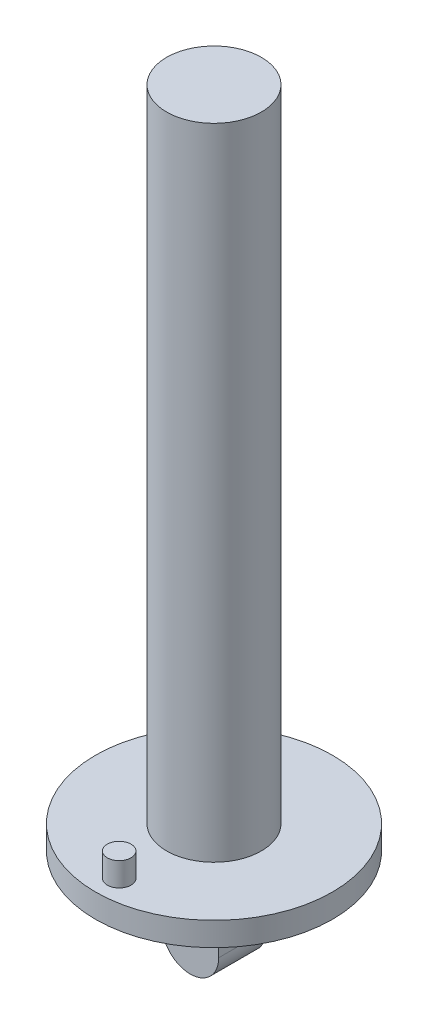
ISO-10303-21;
HEADER;
FILE_DESCRIPTION(('STEP AP214'),'2;1');
FILE_NAME('part.step','',(''),(''),'','','');
FILE_SCHEMA(('AUTOMOTIVE_DESIGN { 1 0 10303 214 1 1 1 1 }'));
ENDSEC;
DATA;
#1=APPLICATION_CONTEXT('core data for automotive mechanical design processes');
#2=APPLICATION_PROTOCOL_DEFINITION('international standard','automotive_design',2000,#1);
#3=PRODUCT_CONTEXT('',#1,'mechanical');
#4=PRODUCT('Part','Part','',(#3));
#5=PRODUCT_RELATED_PRODUCT_CATEGORY('part','',(#4));
#6=PRODUCT_DEFINITION_FORMATION('','',#4);
#7=PRODUCT_DEFINITION_CONTEXT('part definition',#1,'design');
#8=PRODUCT_DEFINITION('design','',#6,#7);
#9=PRODUCT_DEFINITION_SHAPE('','',#8);
#10=(LENGTH_UNIT() NAMED_UNIT(*) SI_UNIT(.MILLI.,.METRE.));
#11=(NAMED_UNIT(*) PLANE_ANGLE_UNIT() SI_UNIT($,.RADIAN.));
#12=(NAMED_UNIT(*) SI_UNIT($,.STERADIAN.) SOLID_ANGLE_UNIT());
#13=UNCERTAINTY_MEASURE_WITH_UNIT(LENGTH_MEASURE(1.E-05),#10,'distance_accuracy_value','');
#14=(GEOMETRIC_REPRESENTATION_CONTEXT(3) GLOBAL_UNCERTAINTY_ASSIGNED_CONTEXT((#13)) GLOBAL_UNIT_ASSIGNED_CONTEXT((#10,
#11,#12)) REPRESENTATION_CONTEXT('',''));
#15=CARTESIAN_POINT('',(0.,0.,0.));
#16=DIRECTION('',(0.,0.,1.));
#17=DIRECTION('',(1.,0.,0.));
#18=AXIS2_PLACEMENT_3D('',#15,#16,#17);
#19=CARTESIAN_POINT('',(0.,0.,0.));
#20=DIRECTION('',(0.,1.,0.));
#21=DIRECTION('',(-1.,0.,0.));
#22=AXIS2_PLACEMENT_3D('',#19,#20,#21);
#23=PLANE('',#22);
#24=CARTESIAN_POINT('',(0.,0.,0.));
#25=DIRECTION('',(0.,1.,0.));
#26=DIRECTION('',(-1.,0.,0.));
#27=AXIS2_PLACEMENT_3D('',#24,#25,#26);
#28=CIRCLE('',#27,25.);
#29=CARTESIAN_POINT('',(-25.,0.,0.));
#30=VERTEX_POINT('',#29);
#31=EDGE_CURVE('E121',#30,#30,#28,.T.);
#32=ORIENTED_EDGE('',*,*,#31,.F.);
#33=EDGE_LOOP('',(#32));
#34=FACE_BOUND('',#33,.T.);
#35=DIRECTION('',(-1.,0.,0.));
#36=VECTOR('',#35,1.);
#37=CARTESIAN_POINT('',(-6.,0.,-5.));
#38=LINE('',#37,#36);
#39=CARTESIAN_POINT('',(6.,0.,-5.));
#40=VERTEX_POINT('',#39);
#41=CARTESIAN_POINT('',(-6.,0.,-5.));
#42=VERTEX_POINT('',#41);
#43=EDGE_CURVE('E105',#40,#42,#38,.T.);
#44=ORIENTED_EDGE('',*,*,#43,.T.);
#45=DIRECTION('',(0.,0.,1.));
#46=VECTOR('',#45,1.);
#47=CARTESIAN_POINT('',(-6.,0.,-5.));
#48=LINE('',#47,#46);
#49=CARTESIAN_POINT('',(-6.,0.,5.));
#50=VERTEX_POINT('',#49);
#51=EDGE_CURVE('E97',#42,#50,#48,.T.);
#52=ORIENTED_EDGE('',*,*,#51,.T.);
#53=DIRECTION('',(-1.,0.,0.));
#54=VECTOR('',#53,1.);
#55=CARTESIAN_POINT('',(-6.,0.,5.));
#56=LINE('',#55,#54);
#57=CARTESIAN_POINT('',(6.,0.,5.));
#58=VERTEX_POINT('',#57);
#59=EDGE_CURVE('E82',#58,#50,#56,.T.);
#60=ORIENTED_EDGE('',*,*,#59,.F.);
#61=DIRECTION('',(0.,0.,1.));
#62=VECTOR('',#61,1.);
#63=CARTESIAN_POINT('',(6.,0.,-5.));
#64=LINE('',#63,#62);
#65=EDGE_CURVE('E107',#40,#58,#64,.T.);
#66=ORIENTED_EDGE('',*,*,#65,.F.);
#67=EDGE_LOOP('',(#44,#52,#60,#66));
#68=FACE_BOUND('',#67,.T.);
#69=ADVANCED_FACE('F35',(#34,#68),#23,.F.);
#70=CARTESIAN_POINT('',(0.,140.,0.));
#71=DIRECTION('',(0.,1.,0.));
#72=DIRECTION('',(-1.,0.,0.));
#73=AXIS2_PLACEMENT_3D('',#70,#71,#72);
#74=CYLINDRICAL_SURFACE('',#73,25.);
#75=CARTESIAN_POINT('',(0.,5.,0.));
#76=DIRECTION('',(0.,1.,0.));
#77=DIRECTION('',(-1.,0.,0.));
#78=AXIS2_PLACEMENT_3D('',#75,#76,#77);
#79=CIRCLE('',#78,25.);
#80=CARTESIAN_POINT('',(-25.,5.00000000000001,0.));
#81=VERTEX_POINT('',#80);
#82=EDGE_CURVE('E118',#81,#81,#79,.T.);
#83=ORIENTED_EDGE('',*,*,#82,.F.);
#84=EDGE_LOOP('',(#83));
#85=FACE_BOUND('',#84,.T.);
#86=ORIENTED_EDGE('',*,*,#31,.T.);
#87=EDGE_LOOP('',(#86));
#88=FACE_BOUND('',#87,.T.);
#89=ADVANCED_FACE('F156',(#85,#88),#74,.T.);
#90=CARTESIAN_POINT('',(25.,5.,0.));
#91=DIRECTION('',(0.,-1.,0.));
#92=DIRECTION('',(1.,0.,0.));
#93=AXIS2_PLACEMENT_3D('',#90,#91,#92);
#94=PLANE('',#93);
#95=CARTESIAN_POINT('',(0.,5.,20.));
#96=DIRECTION('',(0.,-1.,0.));
#97=DIRECTION('',(1.,0.,0.));
#98=AXIS2_PLACEMENT_3D('',#95,#96,#97);
#99=CIRCLE('',#98,2.5);
#100=CARTESIAN_POINT('',(2.5,5.,20.));
#101=VERTEX_POINT('',#100);
#102=EDGE_CURVE('E11',#101,#101,#99,.F.);
#103=ORIENTED_EDGE('',*,*,#102,.F.);
#104=EDGE_LOOP('',(#103));
#105=FACE_BOUND('',#104,.T.);
#106=CARTESIAN_POINT('',(0.,5.,0.));
#107=DIRECTION('',(0.,1.,0.));
#108=DIRECTION('',(-1.,0.,0.));
#109=AXIS2_PLACEMENT_3D('',#106,#107,#108);
#110=CIRCLE('',#109,10.);
#111=CARTESIAN_POINT('',(-10.,5.,0.));
#112=VERTEX_POINT('',#111);
#113=EDGE_CURVE('E110',#112,#112,#110,.T.);
#114=ORIENTED_EDGE('',*,*,#113,.F.);
#115=EDGE_LOOP('',(#114));
#116=FACE_BOUND('',#115,.T.);
#117=ORIENTED_EDGE('',*,*,#82,.T.);
#118=EDGE_LOOP('',(#117));
#119=FACE_BOUND('',#118,.T.);
#120=ADVANCED_FACE('F162',(#105,#116,#119),#94,.F.);
#121=CARTESIAN_POINT('',(0.,140.,0.));
#122=DIRECTION('',(0.,1.,0.));
#123=DIRECTION('',(-1.,0.,0.));
#124=AXIS2_PLACEMENT_3D('',#121,#122,#123);
#125=CYLINDRICAL_SURFACE('',#124,10.);
#126=CARTESIAN_POINT('',(0.,140.,0.));
#127=DIRECTION('',(0.,1.,0.));
#128=DIRECTION('',(-1.,0.,0.));
#129=AXIS2_PLACEMENT_3D('',#126,#127,#128);
#130=CIRCLE('',#129,10.);
#131=CARTESIAN_POINT('',(-10.,140.,0.));
#132=VERTEX_POINT('',#131);
#133=EDGE_CURVE('E106',#132,#132,#130,.T.);
#134=ORIENTED_EDGE('',*,*,#133,.F.);
#135=EDGE_LOOP('',(#134));
#136=FACE_BOUND('',#135,.T.);
#137=ORIENTED_EDGE('',*,*,#113,.T.);
#138=EDGE_LOOP('',(#137));
#139=FACE_BOUND('',#138,.T.);
#140=ADVANCED_FACE('F169',(#136,#139),#125,.T.);
#141=CARTESIAN_POINT('',(10.,140.,0.));
#142=DIRECTION('',(0.,-1.,0.));
#143=DIRECTION('',(1.,0.,0.));
#144=AXIS2_PLACEMENT_3D('',#141,#142,#143);
#145=PLANE('',#144);
#146=ORIENTED_EDGE('',*,*,#133,.T.);
#147=EDGE_LOOP('',(#146));
#148=FACE_BOUND('',#147,.T.);
#149=ADVANCED_FACE('F173',(#148),#145,.F.);
#150=CARTESIAN_POINT('',(-6.,0.,-5.));
#151=DIRECTION('',(-1.,0.,0.));
#152=DIRECTION('',(0.,-1.,0.));
#153=AXIS2_PLACEMENT_3D('',#150,#151,#152);
#154=PLANE('',#153);
#155=DIRECTION('',(0.,-1.,0.));
#156=VECTOR('',#155,1.);
#157=CARTESIAN_POINT('',(-6.,0.,-5.));
#158=LINE('',#157,#156);
#159=CARTESIAN_POINT('',(-6.,-14.,-5.));
#160=VERTEX_POINT('',#159);
#161=EDGE_CURVE('E91',#42,#160,#158,.T.);
#162=ORIENTED_EDGE('',*,*,#161,.T.);
#163=DIRECTION('',(0.,0.,1.));
#164=VECTOR('',#163,1.);
#165=CARTESIAN_POINT('',(-6.,-14.,-5.));
#166=LINE('',#165,#164);
#167=CARTESIAN_POINT('',(-6.,-14.,5.));
#168=VERTEX_POINT('',#167);
#169=EDGE_CURVE('E100',#160,#168,#166,.T.);
#170=ORIENTED_EDGE('',*,*,#169,.T.);
#171=DIRECTION('',(0.,-1.,0.));
#172=VECTOR('',#171,1.);
#173=CARTESIAN_POINT('',(-6.,0.,5.));
#174=LINE('',#173,#172);
#175=EDGE_CURVE('E85',#50,#168,#174,.T.);
#176=ORIENTED_EDGE('',*,*,#175,.F.);
#177=ORIENTED_EDGE('',*,*,#51,.F.);
#178=EDGE_LOOP('',(#162,#170,#176,#177));
#179=FACE_BOUND('',#178,.T.);
#180=ADVANCED_FACE('F96',(#179),#154,.T.);
#181=CARTESIAN_POINT('',(6.,0.,-5.));
#182=DIRECTION('',(1.,0.,0.));
#183=DIRECTION('',(0.,1.,0.));
#184=AXIS2_PLACEMENT_3D('',#181,#182,#183);
#185=PLANE('',#184);
#186=DIRECTION('',(0.,1.,0.));
#187=VECTOR('',#186,1.);
#188=CARTESIAN_POINT('',(6.,0.,5.));
#189=LINE('',#188,#187);
#190=CARTESIAN_POINT('',(6.,-14.,5.));
#191=VERTEX_POINT('',#190);
#192=EDGE_CURVE('E86',#191,#58,#189,.T.);
#193=ORIENTED_EDGE('',*,*,#192,.F.);
#194=DIRECTION('',(0.,0.,1.));
#195=VECTOR('',#194,1.);
#196=CARTESIAN_POINT('',(6.,-14.,-5.));
#197=LINE('',#196,#195);
#198=CARTESIAN_POINT('',(6.,-14.,-5.));
#199=VERTEX_POINT('',#198);
#200=EDGE_CURVE('E43',#191,#199,#197,.F.);
#201=ORIENTED_EDGE('',*,*,#200,.T.);
#202=DIRECTION('',(0.,1.,0.));
#203=VECTOR('',#202,1.);
#204=CARTESIAN_POINT('',(6.,0.,-5.));
#205=LINE('',#204,#203);
#206=EDGE_CURVE('E142',#199,#40,#205,.T.);
#207=ORIENTED_EDGE('',*,*,#206,.T.);
#208=ORIENTED_EDGE('',*,*,#65,.T.);
#209=EDGE_LOOP('',(#193,#201,#207,#208));
#210=FACE_BOUND('',#209,.T.);
#211=ADVANCED_FACE('F143',(#210),#185,.T.);
#212=CARTESIAN_POINT('',(0.,0.,-5.));
#213=DIRECTION('',(0.,0.,1.));
#214=DIRECTION('',(1.,0.,0.));
#215=AXIS2_PLACEMENT_3D('',#212,#213,#214);
#216=PLANE('',#215);
#217=CARTESIAN_POINT('',(0.,-14.,-5.));
#218=DIRECTION('',(0.,0.,1.));
#219=DIRECTION('',(1.,0.,0.));
#220=AXIS2_PLACEMENT_3D('',#217,#218,#219);
#221=CIRCLE('',#220,6.);
#222=CARTESIAN_POINT('',(0.,-20.,-5.));
#223=VERTEX_POINT('',#222);
#224=EDGE_CURVE('E50',#199,#223,#221,.F.);
#225=ORIENTED_EDGE('',*,*,#224,.T.);
#226=CARTESIAN_POINT('',(0.,-14.,-5.));
#227=DIRECTION('',(0.,0.,1.));
#228=DIRECTION('',(1.,0.,0.));
#229=AXIS2_PLACEMENT_3D('',#226,#227,#228);
#230=CIRCLE('',#229,6.);
#231=EDGE_CURVE('E130',#223,#160,#230,.F.);
#232=ORIENTED_EDGE('',*,*,#231,.T.);
#233=ORIENTED_EDGE('',*,*,#161,.F.);
#234=ORIENTED_EDGE('',*,*,#43,.F.);
#235=ORIENTED_EDGE('',*,*,#206,.F.);
#236=EDGE_LOOP('',(#225,#232,#233,#234,#235));
#237=FACE_BOUND('',#236,.T.);
#238=ADVANCED_FACE('F144',(#237),#216,.F.);
#239=CARTESIAN_POINT('',(0.,0.,5.));
#240=DIRECTION('',(0.,0.,1.));
#241=DIRECTION('',(1.,0.,0.));
#242=AXIS2_PLACEMENT_3D('',#239,#240,#241);
#243=PLANE('',#242);
#244=ORIENTED_EDGE('',*,*,#175,.T.);
#245=CARTESIAN_POINT('',(0.,-14.,5.));
#246=DIRECTION('',(0.,0.,1.));
#247=DIRECTION('',(1.,0.,0.));
#248=AXIS2_PLACEMENT_3D('',#245,#246,#247);
#249=CIRCLE('',#248,6.);
#250=CARTESIAN_POINT('',(0.,-20.,5.));
#251=VERTEX_POINT('',#250);
#252=EDGE_CURVE('E127',#168,#251,#249,.T.);
#253=ORIENTED_EDGE('',*,*,#252,.T.);
#254=CARTESIAN_POINT('',(0.,-14.,5.));
#255=DIRECTION('',(0.,0.,1.));
#256=DIRECTION('',(1.,0.,0.));
#257=AXIS2_PLACEMENT_3D('',#254,#255,#256);
#258=CIRCLE('',#257,6.);
#259=EDGE_CURVE('E125',#251,#191,#258,.T.);
#260=ORIENTED_EDGE('',*,*,#259,.T.);
#261=ORIENTED_EDGE('',*,*,#192,.T.);
#262=ORIENTED_EDGE('',*,*,#59,.T.);
#263=EDGE_LOOP('',(#244,#253,#260,#261,#262));
#264=FACE_BOUND('',#263,.T.);
#265=ADVANCED_FACE('F84',(#264),#243,.T.);
#266=CARTESIAN_POINT('',(0.,-14.,-5.));
#267=DIRECTION('',(0.,0.,1.));
#268=DIRECTION('',(1.,0.,0.));
#269=AXIS2_PLACEMENT_3D('',#266,#267,#268);
#270=CYLINDRICAL_SURFACE('',#269,6.);
#271=DIRECTION('',(0.,0.,1.));
#272=VECTOR('',#271,1.);
#273=CARTESIAN_POINT('',(0.,-20.,-5.));
#274=LINE('',#273,#272);
#275=EDGE_CURVE('E101',#223,#251,#274,.T.);
#276=ORIENTED_EDGE('',*,*,#275,.F.);
#277=ORIENTED_EDGE('',*,*,#224,.F.);
#278=ORIENTED_EDGE('',*,*,#200,.F.);
#279=ORIENTED_EDGE('',*,*,#259,.F.);
#280=EDGE_LOOP('',(#276,#277,#278,#279));
#281=FACE_BOUND('',#280,.T.);
#282=ADVANCED_FACE('F37',(#281),#270,.T.);
#283=CARTESIAN_POINT('',(0.,-14.,-5.));
#284=DIRECTION('',(0.,0.,1.));
#285=DIRECTION('',(1.,0.,0.));
#286=AXIS2_PLACEMENT_3D('',#283,#284,#285);
#287=CYLINDRICAL_SURFACE('',#286,6.);
#288=ORIENTED_EDGE('',*,*,#231,.F.);
#289=ORIENTED_EDGE('',*,*,#275,.T.);
#290=ORIENTED_EDGE('',*,*,#252,.F.);
#291=ORIENTED_EDGE('',*,*,#169,.F.);
#292=EDGE_LOOP('',(#288,#289,#290,#291));
#293=FACE_BOUND('',#292,.T.);
#294=ADVANCED_FACE('F145',(#293),#287,.T.);
#295=CARTESIAN_POINT('',(0.,10.,20.));
#296=DIRECTION('',(0.,-1.,0.));
#297=DIRECTION('',(1.,0.,0.));
#298=AXIS2_PLACEMENT_3D('',#295,#296,#297);
#299=CYLINDRICAL_SURFACE('',#298,2.5);
#300=CARTESIAN_POINT('',(0.,10.,20.));
#301=DIRECTION('',(0.,1.,0.));
#302=DIRECTION('',(-1.,0.,0.));
#303=AXIS2_PLACEMENT_3D('',#300,#301,#302);
#304=CIRCLE('',#303,2.5);
#305=CARTESIAN_POINT('',(-2.5,10.,20.));
#306=VERTEX_POINT('',#305);
#307=EDGE_CURVE('E133',#306,#306,#304,.T.);
#308=ORIENTED_EDGE('',*,*,#307,.F.);
#309=EDGE_LOOP('',(#308));
#310=FACE_BOUND('',#309,.T.);
#311=ORIENTED_EDGE('',*,*,#102,.T.);
#312=EDGE_LOOP('',(#311));
#313=FACE_BOUND('',#312,.T.);
#314=ADVANCED_FACE('F153',(#310,#313),#299,.T.);
#315=CARTESIAN_POINT('',(0.,10.,20.));
#316=DIRECTION('',(0.,1.,0.));
#317=DIRECTION('',(-1.,0.,0.));
#318=AXIS2_PLACEMENT_3D('',#315,#316,#317);
#319=PLANE('',#318);
#320=ORIENTED_EDGE('',*,*,#307,.T.);
#321=EDGE_LOOP('',(#320));
#322=FACE_BOUND('',#321,.T.);
#323=ADVANCED_FACE('F186',(#322),#319,.T.);
#324=CLOSED_SHELL('',(#69,#89,#120,#140,#149,#180,#211,#238,#265,#282,#294,#314,#323));
#325=MANIFOLD_SOLID_BREP('B2',#324);
#326=ADVANCED_BREP_SHAPE_REPRESENTATION('',(#18,#325),#14);
#327=SHAPE_DEFINITION_REPRESENTATION(#9,#326);
ENDSEC;
END-ISO-10303-21;
